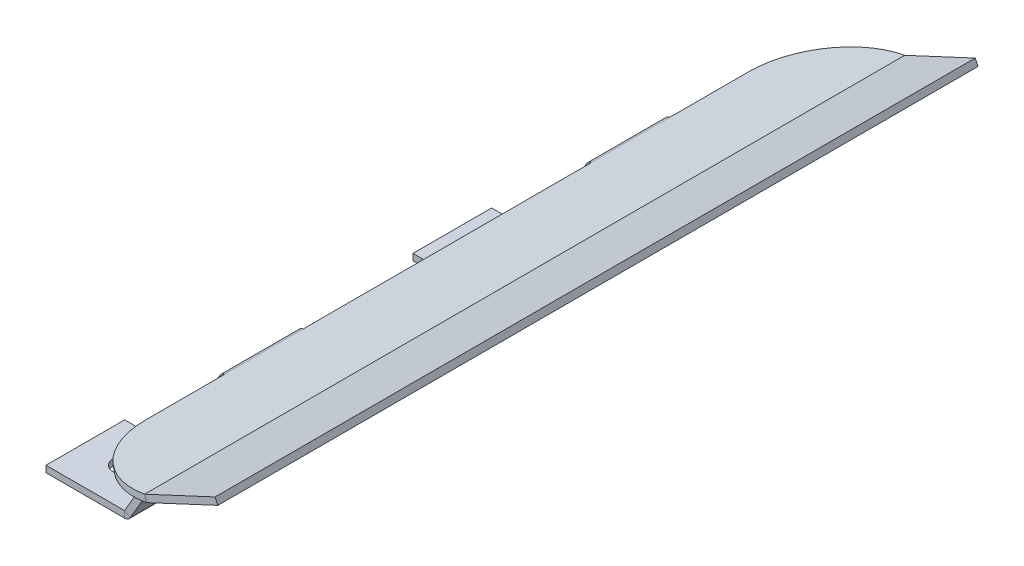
ISO-10303-21;
HEADER;
FILE_DESCRIPTION(('STEP AP214'),'2;1');
FILE_NAME('part.step','',(''),(''),'','','');
FILE_SCHEMA(('AUTOMOTIVE_DESIGN { 1 0 10303 214 1 1 1 1 }'));
ENDSEC;
DATA;
#1=APPLICATION_CONTEXT('core data for automotive mechanical design processes');
#2=APPLICATION_PROTOCOL_DEFINITION('international standard','automotive_design',2000,#1);
#3=PRODUCT_CONTEXT('',#1,'mechanical');
#4=PRODUCT('Part','Part','',(#3));
#5=PRODUCT_RELATED_PRODUCT_CATEGORY('part','',(#4));
#6=PRODUCT_DEFINITION_FORMATION('','',#4);
#7=PRODUCT_DEFINITION_CONTEXT('part definition',#1,'design');
#8=PRODUCT_DEFINITION('design','',#6,#7);
#9=PRODUCT_DEFINITION_SHAPE('','',#8);
#10=(LENGTH_UNIT() NAMED_UNIT(*) SI_UNIT(.MILLI.,.METRE.));
#11=(NAMED_UNIT(*) PLANE_ANGLE_UNIT() SI_UNIT($,.RADIAN.));
#12=(NAMED_UNIT(*) SI_UNIT($,.STERADIAN.) SOLID_ANGLE_UNIT());
#13=UNCERTAINTY_MEASURE_WITH_UNIT(LENGTH_MEASURE(1.E-05),#10,'distance_accuracy_value','');
#14=(GEOMETRIC_REPRESENTATION_CONTEXT(3) GLOBAL_UNCERTAINTY_ASSIGNED_CONTEXT((#13)) GLOBAL_UNIT_ASSIGNED_CONTEXT((#10,
#11,#12)) REPRESENTATION_CONTEXT('',''));
#15=CARTESIAN_POINT('',(0.,0.,0.));
#16=DIRECTION('',(0.,0.,1.));
#17=DIRECTION('',(1.,0.,0.));
#18=AXIS2_PLACEMENT_3D('',#15,#16,#17);
#19=CARTESIAN_POINT('',(-9.26145696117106,35.9192102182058,-46.));
#20=DIRECTION('',(-0.86602540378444,0.499999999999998,0.));
#21=DIRECTION('',(0.,0.,1.));
#22=AXIS2_PLACEMENT_3D('',#19,#20,#21);
#23=PLANE('',#22);
#24=DIRECTION('',(0.499999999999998,0.86602540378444,0.));
#25=VECTOR('',#24,1.);
#26=CARTESIAN_POINT('',(-36.261456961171,-10.846161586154,-22.));
#27=LINE('',#26,#25);
#28=CARTESIAN_POINT('',(-29.9991339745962,0.0005000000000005,-22.));
#29=VERTEX_POINT('',#28);
#30=CARTESIAN_POINT('',(-15.4948439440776,25.1226672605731,-22.));
#31=VERTEX_POINT('',#30);
#32=EDGE_CURVE('E63',#29,#31,#27,.T.);
#33=ORIENTED_EDGE('',*,*,#32,.T.);
#34=DIRECTION('',(0.,0.,-1.));
#35=VECTOR('',#34,1.);
#36=CARTESIAN_POINT('',(-15.4948439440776,25.1226672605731,-46.));
#37=LINE('',#36,#35);
#38=CARTESIAN_POINT('',(-15.4948439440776,25.1226672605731,-34.));
#39=VERTEX_POINT('',#38);
#40=EDGE_CURVE('E55',#31,#39,#37,.T.);
#41=ORIENTED_EDGE('',*,*,#40,.T.);
#42=DIRECTION('',(-0.499999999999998,-0.86602540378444,0.));
#43=VECTOR('',#42,1.);
#44=CARTESIAN_POINT('',(-15.261456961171,25.5269053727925,-34.));
#45=LINE('',#44,#43);
#46=CARTESIAN_POINT('',(-29.9991339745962,0.0005000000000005,-34.));
#47=VERTEX_POINT('',#46);
#48=EDGE_CURVE('E70',#39,#47,#45,.T.);
#49=ORIENTED_EDGE('',*,*,#48,.T.);
#50=DIRECTION('',(0.,0.,-1.));
#51=VECTOR('',#50,1.);
#52=CARTESIAN_POINT('',(-29.9991339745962,0.000499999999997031,-46.));
#53=LINE('',#52,#51);
#54=EDGE_CURVE('E554',#29,#47,#53,.T.);
#55=ORIENTED_EDGE('',*,*,#54,.F.);
#56=EDGE_LOOP('',(#33,#41,#49,#55));
#57=FACE_BOUND('',#56,.T.);
#58=ADVANCED_FACE('F46',(#57),#23,.T.);
#59=CARTESIAN_POINT('',(-35.3954315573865,-11.346161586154,-22.));
#60=DIRECTION('',(0.,0.,1.));
#61=DIRECTION('',(0.499999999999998,0.86602540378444,0.));
#62=AXIS2_PLACEMENT_3D('',#59,#60,#61);
#63=PLANE('',#62);
#64=DIRECTION('',(0.499999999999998,0.86602540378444,0.));
#65=VECTOR('',#64,1.);
#66=CARTESIAN_POINT('',(-35.3954315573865,-11.346161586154,-22.));
#67=LINE('',#66,#65);
#68=CARTESIAN_POINT('',(-29.1331085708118,-0.499499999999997,-22.));
#69=VERTEX_POINT('',#68);
#70=CARTESIAN_POINT('',(-14.6288185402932,24.6226672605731,-22.));
#71=VERTEX_POINT('',#70);
#72=EDGE_CURVE('E566',#69,#71,#67,.T.);
#73=ORIENTED_EDGE('',*,*,#72,.T.);
#74=DIRECTION('',(-0.86602540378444,0.499999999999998,0.));
#75=VECTOR('',#74,1.);
#76=CARTESIAN_POINT('',(-14.6288185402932,24.6226672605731,-22.));
#77=LINE('',#76,#75);
#78=EDGE_CURVE('E12',#71,#31,#77,.T.);
#79=ORIENTED_EDGE('',*,*,#78,.T.);
#80=ORIENTED_EDGE('',*,*,#32,.F.);
#81=DIRECTION('',(-0.86602540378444,0.499999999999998,0.));
#82=VECTOR('',#81,1.);
#83=CARTESIAN_POINT('',(-29.1331085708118,-0.499499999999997,-22.));
#84=LINE('',#83,#82);
#85=EDGE_CURVE('E551',#69,#29,#84,.T.);
#86=ORIENTED_EDGE('',*,*,#85,.F.);
#87=EDGE_LOOP('',(#73,#79,#80,#86));
#88=FACE_BOUND('',#87,.T.);
#89=ADVANCED_FACE('F48',(#88),#63,.T.);
#90=CARTESIAN_POINT('',(-14.3954315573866,25.0269053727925,-34.));
#91=DIRECTION('',(0.,0.,-1.));
#92=DIRECTION('',(-0.499999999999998,-0.86602540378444,0.));
#93=AXIS2_PLACEMENT_3D('',#90,#91,#92);
#94=PLANE('',#93);
#95=ORIENTED_EDGE('',*,*,#48,.F.);
#96=DIRECTION('',(0.86602540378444,-0.499999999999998,0.));
#97=VECTOR('',#96,1.);
#98=CARTESIAN_POINT('',(-14.6288185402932,24.6226672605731,-34.));
#99=LINE('',#98,#97);
#100=CARTESIAN_POINT('',(-14.6288185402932,24.6226672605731,-34.));
#101=VERTEX_POINT('',#100);
#102=EDGE_CURVE('E563',#39,#101,#99,.T.);
#103=ORIENTED_EDGE('',*,*,#102,.T.);
#104=DIRECTION('',(-0.499999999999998,-0.86602540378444,0.));
#105=VECTOR('',#104,1.);
#106=CARTESIAN_POINT('',(-14.3954315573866,25.0269053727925,-34.));
#107=LINE('',#106,#105);
#108=CARTESIAN_POINT('',(-29.1331085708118,-0.499499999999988,-34.));
#109=VERTEX_POINT('',#108);
#110=EDGE_CURVE('E50',#101,#109,#107,.T.);
#111=ORIENTED_EDGE('',*,*,#110,.T.);
#112=DIRECTION('',(0.86602540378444,-0.499999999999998,0.));
#113=VECTOR('',#112,1.);
#114=CARTESIAN_POINT('',(-29.1331085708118,-0.4995,-34.));
#115=LINE('',#114,#113);
#116=EDGE_CURVE('E557',#47,#109,#115,.T.);
#117=ORIENTED_EDGE('',*,*,#116,.F.);
#118=EDGE_LOOP('',(#95,#103,#111,#117));
#119=FACE_BOUND('',#118,.T.);
#120=ADVANCED_FACE('F571',(#119),#94,.T.);
#121=CARTESIAN_POINT('',(-8.39543155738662,35.4192102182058,-46.));
#122=DIRECTION('',(-0.86602540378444,0.499999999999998,0.));
#123=DIRECTION('',(0.,0.,1.));
#124=AXIS2_PLACEMENT_3D('',#121,#122,#123);
#125=PLANE('',#124);
#126=DIRECTION('',(0.,0.,-1.));
#127=VECTOR('',#126,1.);
#128=CARTESIAN_POINT('',(-14.6288185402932,24.6226672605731,-46.));
#129=LINE('',#128,#127);
#130=EDGE_CURVE('E560',#71,#101,#129,.T.);
#131=ORIENTED_EDGE('',*,*,#130,.F.);
#132=ORIENTED_EDGE('',*,*,#72,.F.);
#133=DIRECTION('',(0.,0.,-1.));
#134=VECTOR('',#133,1.);
#135=CARTESIAN_POINT('',(-29.1331085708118,-0.4995,-46.));
#136=LINE('',#135,#134);
#137=EDGE_CURVE('E548',#69,#109,#136,.T.);
#138=ORIENTED_EDGE('',*,*,#137,.T.);
#139=ORIENTED_EDGE('',*,*,#110,.F.);
#140=EDGE_LOOP('',(#131,#132,#138,#139));
#141=FACE_BOUND('',#140,.T.);
#142=ADVANCED_FACE('F625',(#141),#125,.F.);
#143=CARTESIAN_POINT('',(-30.,0.000999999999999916,-22.));
#144=DIRECTION('',(0.,0.,1.));
#145=DIRECTION('',(1.,0.,0.));
#146=AXIS2_PLACEMENT_3D('',#143,#144,#145);
#147=PLANE('',#146);
#148=ORIENTED_EDGE('',*,*,#85,.T.);
#149=CARTESIAN_POINT('',(-30.,0.000999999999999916,-22.));
#150=DIRECTION('',(0.,0.,1.));
#151=DIRECTION('',(1.,0.,0.));
#152=AXIS2_PLACEMENT_3D('',#149,#150,#151);
#153=CIRCLE('',#152,0.000999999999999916);
#154=CARTESIAN_POINT('',(-30.,0.,-22.));
#155=VERTEX_POINT('',#154);
#156=EDGE_CURVE('E503',#29,#155,#153,.F.);
#157=ORIENTED_EDGE('',*,*,#156,.T.);
#158=DIRECTION('',(0.,1.,0.));
#159=VECTOR('',#158,1.);
#160=CARTESIAN_POINT('',(-30.,-1.,-22.));
#161=LINE('',#160,#159);
#162=CARTESIAN_POINT('',(-30.,-1.,-22.));
#163=VERTEX_POINT('',#162);
#164=EDGE_CURVE('E518',#163,#155,#161,.T.);
#165=ORIENTED_EDGE('',*,*,#164,.F.);
#166=CARTESIAN_POINT('',(-30.,0.000999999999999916,-22.));
#167=DIRECTION('',(0.,0.,-1.));
#168=DIRECTION('',(1.,0.,0.));
#169=AXIS2_PLACEMENT_3D('',#166,#167,#168);
#170=CIRCLE('',#169,1.001);
#171=EDGE_CURVE('E537',#69,#163,#170,.T.);
#172=ORIENTED_EDGE('',*,*,#171,.F.);
#173=EDGE_LOOP('',(#148,#157,#165,#172));
#174=FACE_BOUND('',#173,.T.);
#175=ADVANCED_FACE('F597',(#174),#147,.T.);
#176=CARTESIAN_POINT('',(-30.,0.000999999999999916,-34.));
#177=DIRECTION('',(0.,0.,-1.));
#178=DIRECTION('',(-1.,0.,0.));
#179=AXIS2_PLACEMENT_3D('',#176,#177,#178);
#180=PLANE('',#179);
#181=CARTESIAN_POINT('',(-30.,0.000999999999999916,-34.));
#182=DIRECTION('',(0.,0.,1.));
#183=DIRECTION('',(1.,0.,0.));
#184=AXIS2_PLACEMENT_3D('',#181,#182,#183);
#185=CIRCLE('',#184,0.000999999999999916);
#186=CARTESIAN_POINT('',(-30.,0.,-34.));
#187=VERTEX_POINT('',#186);
#188=EDGE_CURVE('E541',#187,#47,#185,.T.);
#189=ORIENTED_EDGE('',*,*,#188,.T.);
#190=ORIENTED_EDGE('',*,*,#116,.T.);
#191=CARTESIAN_POINT('',(-30.,0.000999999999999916,-34.));
#192=DIRECTION('',(0.,0.,1.));
#193=DIRECTION('',(-1.,0.,0.));
#194=AXIS2_PLACEMENT_3D('',#191,#192,#193);
#195=CIRCLE('',#194,1.001);
#196=CARTESIAN_POINT('',(-30.,-1.,-34.));
#197=VERTEX_POINT('',#196);
#198=EDGE_CURVE('E540',#197,#109,#195,.T.);
#199=ORIENTED_EDGE('',*,*,#198,.F.);
#200=DIRECTION('',(0.,-1.,0.));
#201=VECTOR('',#200,1.);
#202=CARTESIAN_POINT('',(-30.,-1.,-34.));
#203=LINE('',#202,#201);
#204=EDGE_CURVE('E506',#187,#197,#203,.T.);
#205=ORIENTED_EDGE('',*,*,#204,.F.);
#206=EDGE_LOOP('',(#189,#190,#199,#205));
#207=FACE_BOUND('',#206,.T.);
#208=ADVANCED_FACE('F581',(#207),#180,.T.);
#209=CARTESIAN_POINT('',(-30.,0.000999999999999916,-40.0530184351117));
#210=DIRECTION('',(0.,0.,1.));
#211=DIRECTION('',(1.,0.,0.));
#212=AXIS2_PLACEMENT_3D('',#209,#210,#211);
#213=CYLINDRICAL_SURFACE('',#212,1.001);
#214=DIRECTION('',(0.,0.,-1.));
#215=VECTOR('',#214,1.);
#216=CARTESIAN_POINT('',(-30.,-1.,-46.));
#217=LINE('',#216,#215);
#218=EDGE_CURVE('E368',#163,#197,#217,.T.);
#219=ORIENTED_EDGE('',*,*,#218,.T.);
#220=ORIENTED_EDGE('',*,*,#198,.T.);
#221=ORIENTED_EDGE('',*,*,#137,.F.);
#222=ORIENTED_EDGE('',*,*,#171,.T.);
#223=EDGE_LOOP('',(#219,#220,#221,#222));
#224=FACE_BOUND('',#223,.T.);
#225=ADVANCED_FACE('F592',(#224),#213,.T.);
#226=CARTESIAN_POINT('',(-30.,0.000999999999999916,-40.0530184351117));
#227=DIRECTION('',(0.,0.,1.));
#228=DIRECTION('',(1.,0.,0.));
#229=AXIS2_PLACEMENT_3D('',#226,#227,#228);
#230=CYLINDRICAL_SURFACE('',#229,0.000999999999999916);
#231=DIRECTION('',(0.,0.,-1.));
#232=VECTOR('',#231,1.);
#233=CARTESIAN_POINT('',(-30.,0.,-46.));
#234=LINE('',#233,#232);
#235=EDGE_CURVE('E513',#155,#187,#234,.T.);
#236=ORIENTED_EDGE('',*,*,#235,.F.);
#237=ORIENTED_EDGE('',*,*,#156,.F.);
#238=ORIENTED_EDGE('',*,*,#54,.T.);
#239=ORIENTED_EDGE('',*,*,#188,.F.);
#240=EDGE_LOOP('',(#236,#237,#238,#239));
#241=FACE_BOUND('',#240,.T.);
#242=ADVANCED_FACE('F579',(#241),#230,.F.);
#243=CARTESIAN_POINT('',(-36.,-1.,-28.));
#244=DIRECTION('',(0.,1.,0.));
#245=DIRECTION('',(0.,0.,1.));
#246=AXIS2_PLACEMENT_3D('',#243,#244,#245);
#247=CYLINDRICAL_SURFACE('',#246,1.75);
#248=CARTESIAN_POINT('',(-36.,-1.,-28.));
#249=DIRECTION('',(0.,1.,0.));
#250=DIRECTION('',(0.,0.,1.));
#251=AXIS2_PLACEMENT_3D('',#248,#249,#250);
#252=CIRCLE('',#251,1.75);
#253=CARTESIAN_POINT('',(-36.,-1.,-26.25));
#254=VERTEX_POINT('',#253);
#255=EDGE_CURVE('E524',#254,#254,#252,.T.);
#256=ORIENTED_EDGE('',*,*,#255,.F.);
#257=EDGE_LOOP('',(#256));
#258=FACE_BOUND('',#257,.T.);
#259=CARTESIAN_POINT('',(-36.,0.,-28.));
#260=DIRECTION('',(0.,1.,0.));
#261=DIRECTION('',(0.,0.,1.));
#262=AXIS2_PLACEMENT_3D('',#259,#260,#261);
#263=CIRCLE('',#262,1.75);
#264=CARTESIAN_POINT('',(-36.,0.,-26.25));
#265=VERTEX_POINT('',#264);
#266=EDGE_CURVE('E532',#265,#265,#263,.T.);
#267=ORIENTED_EDGE('',*,*,#266,.T.);
#268=EDGE_LOOP('',(#267));
#269=FACE_BOUND('',#268,.T.);
#270=ADVANCED_FACE('F608',(#258,#269),#247,.F.);
#271=CARTESIAN_POINT('',(-42.,-1.,-34.));
#272=DIRECTION('',(-1.,0.,0.));
#273=DIRECTION('',(0.,0.,1.));
#274=AXIS2_PLACEMENT_3D('',#271,#272,#273);
#275=PLANE('',#274);
#276=DIRECTION('',(0.,0.,1.));
#277=VECTOR('',#276,1.);
#278=CARTESIAN_POINT('',(-42.,0.,-34.));
#279=LINE('',#278,#277);
#280=CARTESIAN_POINT('',(-42.,0.,-34.));
#281=VERTEX_POINT('',#280);
#282=CARTESIAN_POINT('',(-42.,0.,-22.));
#283=VERTEX_POINT('',#282);
#284=EDGE_CURVE('E508',#281,#283,#279,.T.);
#285=ORIENTED_EDGE('',*,*,#284,.F.);
#286=DIRECTION('',(0.,1.,0.));
#287=VECTOR('',#286,1.);
#288=CARTESIAN_POINT('',(-42.,-1.,-34.));
#289=LINE('',#288,#287);
#290=CARTESIAN_POINT('',(-42.,-1.,-34.));
#291=VERTEX_POINT('',#290);
#292=EDGE_CURVE('E500',#291,#281,#289,.T.);
#293=ORIENTED_EDGE('',*,*,#292,.F.);
#294=DIRECTION('',(0.,0.,1.));
#295=VECTOR('',#294,1.);
#296=CARTESIAN_POINT('',(-42.,-1.,-34.));
#297=LINE('',#296,#295);
#298=CARTESIAN_POINT('',(-42.,-1.,-22.));
#299=VERTEX_POINT('',#298);
#300=EDGE_CURVE('E529',#291,#299,#297,.T.);
#301=ORIENTED_EDGE('',*,*,#300,.T.);
#302=DIRECTION('',(0.,1.,0.));
#303=VECTOR('',#302,1.);
#304=CARTESIAN_POINT('',(-42.,-1.,-22.));
#305=LINE('',#304,#303);
#306=EDGE_CURVE('E527',#299,#283,#305,.T.);
#307=ORIENTED_EDGE('',*,*,#306,.T.);
#308=EDGE_LOOP('',(#285,#293,#301,#307));
#309=FACE_BOUND('',#308,.T.);
#310=ADVANCED_FACE('F606',(#309),#275,.T.);
#311=CARTESIAN_POINT('',(12.,-1.,-46.));
#312=DIRECTION('',(0.,1.,0.));
#313=DIRECTION('',(0.,0.,1.));
#314=AXIS2_PLACEMENT_3D('',#311,#312,#313);
#315=PLANE('',#314);
#316=ORIENTED_EDGE('',*,*,#218,.F.);
#317=DIRECTION('',(1.,0.,0.));
#318=VECTOR('',#317,1.);
#319=CARTESIAN_POINT('',(-42.,-1.,-22.));
#320=LINE('',#319,#318);
#321=EDGE_CURVE('E521',#299,#163,#320,.T.);
#322=ORIENTED_EDGE('',*,*,#321,.F.);
#323=ORIENTED_EDGE('',*,*,#300,.F.);
#324=DIRECTION('',(-1.,0.,0.));
#325=VECTOR('',#324,1.);
#326=CARTESIAN_POINT('',(0.,-1.,-34.));
#327=LINE('',#326,#325);
#328=EDGE_CURVE('E504',#197,#291,#327,.T.);
#329=ORIENTED_EDGE('',*,*,#328,.F.);
#330=EDGE_LOOP('',(#316,#322,#323,#329));
#331=FACE_BOUND('',#330,.T.);
#332=ORIENTED_EDGE('',*,*,#255,.T.);
#333=EDGE_LOOP('',(#332));
#334=FACE_BOUND('',#333,.T.);
#335=ADVANCED_FACE('F588',(#331,#334),#315,.F.);
#336=CARTESIAN_POINT('',(-42.,-1.,-22.));
#337=DIRECTION('',(0.,0.,1.));
#338=DIRECTION('',(1.,0.,0.));
#339=AXIS2_PLACEMENT_3D('',#336,#337,#338);
#340=PLANE('',#339);
#341=ORIENTED_EDGE('',*,*,#321,.T.);
#342=ORIENTED_EDGE('',*,*,#164,.T.);
#343=DIRECTION('',(1.,0.,0.));
#344=VECTOR('',#343,1.);
#345=CARTESIAN_POINT('',(-42.,0.,-22.));
#346=LINE('',#345,#344);
#347=EDGE_CURVE('E516',#283,#155,#346,.T.);
#348=ORIENTED_EDGE('',*,*,#347,.F.);
#349=ORIENTED_EDGE('',*,*,#306,.F.);
#350=EDGE_LOOP('',(#341,#342,#348,#349));
#351=FACE_BOUND('',#350,.T.);
#352=ADVANCED_FACE('F601',(#351),#340,.T.);
#353=CARTESIAN_POINT('',(12.,0.,-46.));
#354=DIRECTION('',(0.,1.,0.));
#355=DIRECTION('',(0.,0.,1.));
#356=AXIS2_PLACEMENT_3D('',#353,#354,#355);
#357=PLANE('',#356);
#358=ORIENTED_EDGE('',*,*,#266,.F.);
#359=EDGE_LOOP('',(#358));
#360=FACE_BOUND('',#359,.T.);
#361=ORIENTED_EDGE('',*,*,#347,.T.);
#362=ORIENTED_EDGE('',*,*,#235,.T.);
#363=DIRECTION('',(-1.,0.,0.));
#364=VECTOR('',#363,1.);
#365=CARTESIAN_POINT('',(0.,0.,-34.));
#366=LINE('',#365,#364);
#367=EDGE_CURVE('E511',#187,#281,#366,.T.);
#368=ORIENTED_EDGE('',*,*,#367,.T.);
#369=ORIENTED_EDGE('',*,*,#284,.T.);
#370=EDGE_LOOP('',(#361,#362,#368,#369));
#371=FACE_BOUND('',#370,.T.);
#372=ADVANCED_FACE('F603',(#360,#371),#357,.T.);
#373=CARTESIAN_POINT('',(0.,-1.,-34.));
#374=DIRECTION('',(0.,0.,-1.));
#375=DIRECTION('',(-1.,0.,0.));
#376=AXIS2_PLACEMENT_3D('',#373,#374,#375);
#377=PLANE('',#376);
#378=ORIENTED_EDGE('',*,*,#367,.F.);
#379=ORIENTED_EDGE('',*,*,#204,.T.);
#380=ORIENTED_EDGE('',*,*,#328,.T.);
#381=ORIENTED_EDGE('',*,*,#292,.T.);
#382=EDGE_LOOP('',(#378,#379,#380,#381));
#383=FACE_BOUND('',#382,.T.);
#384=ADVANCED_FACE('F584',(#383),#377,.T.);
#385=CARTESIAN_POINT('',(8.2247264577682,31.8066311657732,-58.));
#386=DIRECTION('',(0.906307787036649,0.4226182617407,0.));
#387=DIRECTION('',(0.,0.,-1.));
#388=AXIS2_PLACEMENT_3D('',#385,#386,#387);
#389=PLANE('',#388);
#390=DIRECTION('',(0.,0.,-1.));
#391=VECTOR('',#390,1.);
#392=CARTESIAN_POINT('',(7.8021081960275,32.7129389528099,-58.));
#393=LINE('',#392,#391);
#394=CARTESIAN_POINT('',(7.80210819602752,32.7129389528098,58.));
#395=VERTEX_POINT('',#394);
#396=CARTESIAN_POINT('',(7.8021081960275,32.7129389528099,-58.));
#397=VERTEX_POINT('',#396);
#398=EDGE_CURVE('E465',#395,#397,#393,.T.);
#399=ORIENTED_EDGE('',*,*,#398,.F.);
#400=DIRECTION('',(-0.4226182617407,0.906307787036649,0.));
#401=VECTOR('',#400,1.);
#402=CARTESIAN_POINT('',(8.22472645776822,31.8066311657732,58.));
#403=LINE('',#402,#401);
#404=CARTESIAN_POINT('',(8.22472645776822,31.8066311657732,58.));
#405=VERTEX_POINT('',#404);
#406=EDGE_CURVE('E473',#405,#395,#403,.T.);
#407=ORIENTED_EDGE('',*,*,#406,.F.);
#408=DIRECTION('',(0.,0.,-1.));
#409=VECTOR('',#408,1.);
#410=CARTESIAN_POINT('',(8.2247264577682,31.8066311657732,-58.));
#411=LINE('',#410,#409);
#412=CARTESIAN_POINT('',(8.2247264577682,31.8066311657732,-58.));
#413=VERTEX_POINT('',#412);
#414=EDGE_CURVE('E480',#405,#413,#411,.T.);
#415=ORIENTED_EDGE('',*,*,#414,.T.);
#416=DIRECTION('',(-0.4226182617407,0.906307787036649,0.));
#417=VECTOR('',#416,1.);
#418=CARTESIAN_POINT('',(8.2247264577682,31.8066311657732,-58.));
#419=LINE('',#418,#417);
#420=EDGE_CURVE('E478',#413,#397,#419,.T.);
#421=ORIENTED_EDGE('',*,*,#420,.T.);
#422=EDGE_LOOP('',(#399,#407,#415,#421));
#423=FACE_BOUND('',#422,.T.);
#424=ADVANCED_FACE('F639',(#423),#389,.T.);
#425=CARTESIAN_POINT('',(-2.65096698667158,26.7352120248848,58.));
#426=DIRECTION('',(0.,0.,1.));
#427=DIRECTION('',(0.906307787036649,0.4226182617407,0.));
#428=AXIS2_PLACEMENT_3D('',#425,#426,#427);
#429=PLANE('',#428);
#430=DIRECTION('',(-0.4226182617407,0.906307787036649,0.));
#431=VECTOR('',#430,1.);
#432=CARTESIAN_POINT('',(-2.53209430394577,26.7906432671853,58.));
#433=LINE('',#432,#431);
#434=CARTESIAN_POINT('',(-2.53209430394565,26.7906432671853,58.));
#435=VERTEX_POINT('',#434);
#436=CARTESIAN_POINT('',(-2.95471256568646,27.6969510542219,58.));
#437=VERTEX_POINT('',#436);
#438=EDGE_CURVE('E460',#435,#437,#433,.T.);
#439=ORIENTED_EDGE('',*,*,#438,.F.);
#440=DIRECTION('',(0.906307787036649,0.4226182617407,0.));
#441=VECTOR('',#440,1.);
#442=CARTESIAN_POINT('',(-2.65096698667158,26.7352120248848,58.));
#443=LINE('',#442,#441);
#444=EDGE_CURVE('E476',#435,#405,#443,.T.);
#445=ORIENTED_EDGE('',*,*,#444,.T.);
#446=ORIENTED_EDGE('',*,*,#406,.T.);
#447=DIRECTION('',(0.906307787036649,0.4226182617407,0.));
#448=VECTOR('',#447,1.);
#449=CARTESIAN_POINT('',(-3.07358524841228,27.6415198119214,58.));
#450=LINE('',#449,#448);
#451=EDGE_CURVE('E468',#437,#395,#450,.T.);
#452=ORIENTED_EDGE('',*,*,#451,.F.);
#453=EDGE_LOOP('',(#439,#445,#446,#452));
#454=FACE_BOUND('',#453,.T.);
#455=ADVANCED_FACE('F662',(#454),#429,.T.);
#456=CARTESIAN_POINT('',(-2.65096698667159,26.7352120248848,-58.));
#457=DIRECTION('',(0.,0.,-1.));
#458=DIRECTION('',(-0.906307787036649,-0.4226182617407,0.));
#459=AXIS2_PLACEMENT_3D('',#456,#457,#458);
#460=PLANE('',#459);
#461=DIRECTION('',(0.4226182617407,-0.906307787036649,0.));
#462=VECTOR('',#461,1.);
#463=CARTESIAN_POINT('',(-2.53209430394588,26.7906432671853,-58.));
#464=LINE('',#463,#462);
#465=CARTESIAN_POINT('',(-2.95471256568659,27.6969510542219,-58.));
#466=VERTEX_POINT('',#465);
#467=CARTESIAN_POINT('',(-2.53209430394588,26.7906432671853,-58.));
#468=VERTEX_POINT('',#467);
#469=EDGE_CURVE('E449',#466,#468,#464,.T.);
#470=ORIENTED_EDGE('',*,*,#469,.F.);
#471=DIRECTION('',(-0.906307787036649,-0.4226182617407,0.));
#472=VECTOR('',#471,1.);
#473=CARTESIAN_POINT('',(-3.07358524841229,27.6415198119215,-58.));
#474=LINE('',#473,#472);
#475=EDGE_CURVE('E462',#397,#466,#474,.T.);
#476=ORIENTED_EDGE('',*,*,#475,.F.);
#477=ORIENTED_EDGE('',*,*,#420,.F.);
#478=DIRECTION('',(-0.906307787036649,-0.4226182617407,0.));
#479=VECTOR('',#478,1.);
#480=CARTESIAN_POINT('',(-2.65096698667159,26.7352120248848,-58.));
#481=LINE('',#480,#479);
#482=EDGE_CURVE('E470',#413,#468,#481,.T.);
#483=ORIENTED_EDGE('',*,*,#482,.T.);
#484=EDGE_LOOP('',(#470,#476,#477,#483));
#485=FACE_BOUND('',#484,.T.);
#486=ADVANCED_FACE('F671',(#485),#460,.T.);
#487=CARTESIAN_POINT('',(-3.07358524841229,27.6415198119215,-46.));
#488=DIRECTION('',(-0.4226182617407,0.906307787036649,0.));
#489=DIRECTION('',(0.,0.,1.));
#490=AXIS2_PLACEMENT_3D('',#487,#488,#489);
#491=PLANE('',#490);
#492=DIRECTION('',(0.,0.,-1.));
#493=VECTOR('',#492,1.);
#494=CARTESIAN_POINT('',(-2.95471256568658,27.6969510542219,-46.));
#495=LINE('',#494,#493);
#496=EDGE_CURVE('E445',#437,#466,#495,.T.);
#497=ORIENTED_EDGE('',*,*,#496,.F.);
#498=ORIENTED_EDGE('',*,*,#451,.T.);
#499=ORIENTED_EDGE('',*,*,#398,.T.);
#500=ORIENTED_EDGE('',*,*,#475,.T.);
#501=EDGE_LOOP('',(#497,#498,#499,#500));
#502=FACE_BOUND('',#501,.T.);
#503=ADVANCED_FACE('F679',(#502),#491,.T.);
#504=CARTESIAN_POINT('',(-2.95513518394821,27.6978573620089,58.));
#505=DIRECTION('',(0.,0.,1.));
#506=DIRECTION('',(0.984807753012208,0.173648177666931,0.));
#507=AXIS2_PLACEMENT_3D('',#504,#505,#506);
#508=PLANE('',#507);
#509=ORIENTED_EDGE('',*,*,#438,.T.);
#510=CARTESIAN_POINT('',(-2.95513518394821,27.6978573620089,58.));
#511=DIRECTION('',(0.,0.,1.));
#512=DIRECTION('',(0.984807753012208,0.173648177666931,0.));
#513=AXIS2_PLACEMENT_3D('',#510,#511,#512);
#514=CIRCLE('',#513,0.000999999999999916);
#515=CARTESIAN_POINT('',(-2.95496153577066,27.6968725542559,58.));
#516=VERTEX_POINT('',#515);
#517=EDGE_CURVE('E458',#437,#516,#514,.F.);
#518=ORIENTED_EDGE('',*,*,#517,.T.);
#519=DIRECTION('',(-0.173648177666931,0.984807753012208,0.));
#520=VECTOR('',#519,1.);
#521=CARTESIAN_POINT('',(-2.78131335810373,26.7120648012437,58.));
#522=LINE('',#521,#520);
#523=CARTESIAN_POINT('',(-2.78131335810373,26.7120648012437,58.));
#524=VERTEX_POINT('',#523);
#525=EDGE_CURVE('E434',#524,#516,#522,.T.);
#526=ORIENTED_EDGE('',*,*,#525,.F.);
#527=CARTESIAN_POINT('',(-2.95513518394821,27.6978573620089,58.));
#528=DIRECTION('',(0.,0.,-1.));
#529=DIRECTION('',(0.984807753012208,0.173648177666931,0.));
#530=AXIS2_PLACEMENT_3D('',#527,#528,#529);
#531=CIRCLE('',#530,1.001);
#532=EDGE_CURVE('E427',#435,#524,#531,.T.);
#533=ORIENTED_EDGE('',*,*,#532,.F.);
#534=EDGE_LOOP('',(#509,#518,#526,#533));
#535=FACE_BOUND('',#534,.T.);
#536=ADVANCED_FACE('F687',(#535),#508,.T.);
#537=CARTESIAN_POINT('',(-2.65096698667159,26.7352120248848,-46.));
#538=DIRECTION('',(-0.4226182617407,0.906307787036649,0.));
#539=DIRECTION('',(0.,0.,1.));
#540=AXIS2_PLACEMENT_3D('',#537,#538,#539);
#541=PLANE('',#540);
#542=ORIENTED_EDGE('',*,*,#444,.F.);
#543=DIRECTION('',(0.,0.,-1.));
#544=VECTOR('',#543,1.);
#545=CARTESIAN_POINT('',(-2.53209430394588,26.7906432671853,-46.));
#546=LINE('',#545,#544);
#547=EDGE_CURVE('E455',#435,#468,#546,.T.);
#548=ORIENTED_EDGE('',*,*,#547,.T.);
#549=ORIENTED_EDGE('',*,*,#482,.F.);
#550=ORIENTED_EDGE('',*,*,#414,.F.);
#551=EDGE_LOOP('',(#542,#548,#549,#550));
#552=FACE_BOUND('',#551,.T.);
#553=ADVANCED_FACE('F695',(#552),#541,.F.);
#554=CARTESIAN_POINT('',(-2.95513518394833,27.6978573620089,-58.));
#555=DIRECTION('',(0.,0.,-1.));
#556=DIRECTION('',(-0.984807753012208,-0.173648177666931,0.));
#557=AXIS2_PLACEMENT_3D('',#554,#555,#556);
#558=PLANE('',#557);
#559=CARTESIAN_POINT('',(-2.95513518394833,27.6978573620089,-58.));
#560=DIRECTION('',(0.,0.,1.));
#561=DIRECTION('',(0.984807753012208,0.173648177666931,0.));
#562=AXIS2_PLACEMENT_3D('',#559,#560,#561);
#563=CIRCLE('',#562,0.000999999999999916);
#564=CARTESIAN_POINT('',(-2.95496153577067,27.6968725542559,-58.));
#565=VERTEX_POINT('',#564);
#566=EDGE_CURVE('E452',#565,#466,#563,.T.);
#567=ORIENTED_EDGE('',*,*,#566,.T.);
#568=ORIENTED_EDGE('',*,*,#469,.T.);
#569=CARTESIAN_POINT('',(-2.95513518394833,27.6978573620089,-58.));
#570=DIRECTION('',(0.,0.,1.));
#571=DIRECTION('',(-0.984807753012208,-0.173648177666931,0.));
#572=AXIS2_PLACEMENT_3D('',#569,#570,#571);
#573=CIRCLE('',#572,1.001);
#574=CARTESIAN_POINT('',(-2.78131335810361,26.7120648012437,-58.));
#575=VERTEX_POINT('',#574);
#576=EDGE_CURVE('E430',#575,#468,#573,.T.);
#577=ORIENTED_EDGE('',*,*,#576,.F.);
#578=DIRECTION('',(-0.173648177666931,0.984807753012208,0.));
#579=VECTOR('',#578,1.);
#580=CARTESIAN_POINT('',(-2.78131335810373,26.7120648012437,-58.));
#581=LINE('',#580,#579);
#582=EDGE_CURVE('E447',#575,#565,#581,.T.);
#583=ORIENTED_EDGE('',*,*,#582,.T.);
#584=EDGE_LOOP('',(#567,#568,#577,#583));
#585=FACE_BOUND('',#584,.T.);
#586=ADVANCED_FACE('F703',(#585),#558,.T.);
#587=CARTESIAN_POINT('',(-2.9551351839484,27.6978573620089,-116.004384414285));
#588=DIRECTION('',(0.,0.,1.));
#589=DIRECTION('',(0.984807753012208,0.173648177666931,0.));
#590=AXIS2_PLACEMENT_3D('',#587,#588,#589);
#591=CYLINDRICAL_SURFACE('',#590,0.000999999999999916);
#592=DIRECTION('',(0.,0.,-1.));
#593=VECTOR('',#592,1.);
#594=CARTESIAN_POINT('',(-2.95496153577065,27.6968725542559,-46.));
#595=LINE('',#594,#593);
#596=EDGE_CURVE('E393',#516,#565,#595,.T.);
#597=ORIENTED_EDGE('',*,*,#596,.F.);
#598=ORIENTED_EDGE('',*,*,#517,.F.);
#599=ORIENTED_EDGE('',*,*,#496,.T.);
#600=ORIENTED_EDGE('',*,*,#566,.F.);
#601=EDGE_LOOP('',(#597,#598,#599,#600));
#602=FACE_BOUND('',#601,.T.);
#603=ADVANCED_FACE('F711',(#602),#591,.F.);
#604=CARTESIAN_POINT('',(-14.5990063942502,24.6282866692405,46.));
#605=DIRECTION('',(-0.984807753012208,-0.173648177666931,0.));
#606=DIRECTION('',(0.,0.,1.));
#607=AXIS2_PLACEMENT_3D('',#604,#605,#606);
#608=PLANE('',#607);
#609=DIRECTION('',(0.,0.,1.));
#610=VECTOR('',#609,1.);
#611=CARTESIAN_POINT('',(-14.7726545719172,25.6130944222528,46.));
#612=LINE('',#611,#610);
#613=CARTESIAN_POINT('',(-14.7726545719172,25.6130944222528,34.));
#614=VERTEX_POINT('',#613);
#615=CARTESIAN_POINT('',(-14.7726545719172,25.6130944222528,46.));
#616=VERTEX_POINT('',#615);
#617=EDGE_CURVE('E399',#614,#616,#612,.T.);
#618=ORIENTED_EDGE('',*,*,#617,.F.);
#619=DIRECTION('',(-0.173648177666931,0.984807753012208,0.));
#620=VECTOR('',#619,1.);
#621=CARTESIAN_POINT('',(-14.5990063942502,24.6282866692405,34.));
#622=LINE('',#621,#620);
#623=CARTESIAN_POINT('',(-14.5990063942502,24.6282866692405,34.));
#624=VERTEX_POINT('',#623);
#625=EDGE_CURVE('E365',#624,#614,#622,.T.);
#626=ORIENTED_EDGE('',*,*,#625,.F.);
#627=DIRECTION('',(0.,0.,1.));
#628=VECTOR('',#627,1.);
#629=CARTESIAN_POINT('',(-14.5990063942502,24.6282866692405,46.));
#630=LINE('',#629,#628);
#631=CARTESIAN_POINT('',(-14.5990063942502,24.6282866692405,46.));
#632=VERTEX_POINT('',#631);
#633=EDGE_CURVE('E442',#624,#632,#630,.T.);
#634=ORIENTED_EDGE('',*,*,#633,.T.);
#635=DIRECTION('',(-0.173648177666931,0.984807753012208,0.));
#636=VECTOR('',#635,1.);
#637=CARTESIAN_POINT('',(-14.5990063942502,24.6282866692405,46.));
#638=LINE('',#637,#636);
#639=EDGE_CURVE('E440',#632,#616,#638,.T.);
#640=ORIENTED_EDGE('',*,*,#639,.T.);
#641=EDGE_LOOP('',(#618,#626,#634,#640));
#642=FACE_BOUND('',#641,.T.);
#643=ADVANCED_FACE('F719',(#642),#608,.T.);
#644=CARTESIAN_POINT('',(-2.78131335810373,26.7120648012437,46.));
#645=DIRECTION('',(-0.173648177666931,0.984807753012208,0.));
#646=DIRECTION('',(0.,0.,1.));
#647=AXIS2_PLACEMENT_3D('',#644,#645,#646);
#648=CYLINDRICAL_SURFACE('',#647,12.);
#649=CARTESIAN_POINT('',(-2.95496153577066,27.6968725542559,46.));
#650=DIRECTION('',(-0.173648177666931,0.984807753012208,0.));
#651=DIRECTION('',(0.,0.,-1.));
#652=AXIS2_PLACEMENT_3D('',#649,#650,#651);
#653=CIRCLE('',#652,12.);
#654=EDGE_CURVE('E396',#616,#516,#653,.T.);
#655=ORIENTED_EDGE('',*,*,#654,.F.);
#656=ORIENTED_EDGE('',*,*,#639,.F.);
#657=CARTESIAN_POINT('',(-2.78131335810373,26.7120648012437,46.));
#658=DIRECTION('',(-0.173648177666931,0.984807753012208,0.));
#659=DIRECTION('',(0.,0.,-1.));
#660=AXIS2_PLACEMENT_3D('',#657,#658,#659);
#661=CIRCLE('',#660,12.);
#662=EDGE_CURVE('E437',#632,#524,#661,.T.);
#663=ORIENTED_EDGE('',*,*,#662,.T.);
#664=ORIENTED_EDGE('',*,*,#525,.T.);
#665=EDGE_LOOP('',(#655,#656,#663,#664));
#666=FACE_BOUND('',#665,.T.);
#667=ADVANCED_FACE('F727',(#666),#648,.T.);
#668=CARTESIAN_POINT('',(-2.9551351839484,27.6978573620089,-116.004384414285));
#669=DIRECTION('',(0.,0.,1.));
#670=DIRECTION('',(0.984807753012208,0.173648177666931,0.));
#671=AXIS2_PLACEMENT_3D('',#668,#669,#670);
#672=CYLINDRICAL_SURFACE('',#671,1.001);
#673=DIRECTION('',(0.,0.,-1.));
#674=VECTOR('',#673,1.);
#675=CARTESIAN_POINT('',(-2.78131335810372,26.7120648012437,-46.));
#676=LINE('',#675,#674);
#677=EDGE_CURVE('E432',#524,#575,#676,.T.);
#678=ORIENTED_EDGE('',*,*,#677,.T.);
#679=ORIENTED_EDGE('',*,*,#576,.T.);
#680=ORIENTED_EDGE('',*,*,#547,.F.);
#681=ORIENTED_EDGE('',*,*,#532,.T.);
#682=EDGE_LOOP('',(#678,#679,#680,#681));
#683=FACE_BOUND('',#682,.T.);
#684=ADVANCED_FACE('F735',(#683),#672,.T.);
#685=CARTESIAN_POINT('',(-2.78131335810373,26.7120648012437,-46.));
#686=DIRECTION('',(-0.173648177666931,0.984807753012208,0.));
#687=DIRECTION('',(0.,0.,1.));
#688=AXIS2_PLACEMENT_3D('',#685,#686,#687);
#689=CYLINDRICAL_SURFACE('',#688,12.);
#690=CARTESIAN_POINT('',(-2.95496153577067,27.6968725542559,-46.));
#691=DIRECTION('',(-0.173648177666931,0.984807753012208,0.));
#692=DIRECTION('',(0.,0.,1.));
#693=AXIS2_PLACEMENT_3D('',#690,#691,#692);
#694=CIRCLE('',#693,12.);
#695=CARTESIAN_POINT('',(-14.7726545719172,25.6130944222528,-46.));
#696=VERTEX_POINT('',#695);
#697=EDGE_CURVE('E390',#565,#696,#694,.T.);
#698=ORIENTED_EDGE('',*,*,#697,.F.);
#699=ORIENTED_EDGE('',*,*,#582,.F.);
#700=CARTESIAN_POINT('',(-2.78131335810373,26.7120648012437,-46.));
#701=DIRECTION('',(-0.173648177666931,0.984807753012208,0.));
#702=DIRECTION('',(0.,0.,1.));
#703=AXIS2_PLACEMENT_3D('',#700,#701,#702);
#704=CIRCLE('',#703,12.);
#705=CARTESIAN_POINT('',(-14.5990063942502,24.6282866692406,-46.));
#706=VERTEX_POINT('',#705);
#707=EDGE_CURVE('E424',#575,#706,#704,.T.);
#708=ORIENTED_EDGE('',*,*,#707,.T.);
#709=DIRECTION('',(-0.173648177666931,0.984807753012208,0.));
#710=VECTOR('',#709,1.);
#711=CARTESIAN_POINT('',(-14.5990063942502,24.6282866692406,-46.));
#712=LINE('',#711,#710);
#713=EDGE_CURVE('E422',#706,#696,#712,.T.);
#714=ORIENTED_EDGE('',*,*,#713,.T.);
#715=EDGE_LOOP('',(#698,#699,#708,#714));
#716=FACE_BOUND('',#715,.T.);
#717=ADVANCED_FACE('F743',(#716),#689,.T.);
#718=CARTESIAN_POINT('',(-14.5990063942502,24.6282866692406,-46.));
#719=DIRECTION('',(-0.984807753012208,-0.173648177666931,0.));
#720=DIRECTION('',(0.,0.,1.));
#721=AXIS2_PLACEMENT_3D('',#718,#719,#720);
#722=PLANE('',#721);
#723=DIRECTION('',(0.,0.,1.));
#724=VECTOR('',#723,1.);
#725=CARTESIAN_POINT('',(-14.7726545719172,25.6130944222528,-46.));
#726=LINE('',#725,#724);
#727=CARTESIAN_POINT('',(-14.7726545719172,25.6130944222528,-34.));
#728=VERTEX_POINT('',#727);
#729=EDGE_CURVE('E387',#696,#728,#726,.T.);
#730=ORIENTED_EDGE('',*,*,#729,.F.);
#731=ORIENTED_EDGE('',*,*,#713,.F.);
#732=DIRECTION('',(0.,0.,1.));
#733=VECTOR('',#732,1.);
#734=CARTESIAN_POINT('',(-14.5990063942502,24.6282866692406,-46.));
#735=LINE('',#734,#733);
#736=CARTESIAN_POINT('',(-14.5990063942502,24.6282866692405,-34.));
#737=VERTEX_POINT('',#736);
#738=EDGE_CURVE('E419',#706,#737,#735,.T.);
#739=ORIENTED_EDGE('',*,*,#738,.T.);
#740=DIRECTION('',(-0.173648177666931,0.984807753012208,0.));
#741=VECTOR('',#740,1.);
#742=CARTESIAN_POINT('',(-14.5990063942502,24.6282866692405,-34.));
#743=LINE('',#742,#741);
#744=EDGE_CURVE('E417',#737,#728,#743,.T.);
#745=ORIENTED_EDGE('',*,*,#744,.T.);
#746=EDGE_LOOP('',(#730,#731,#739,#745));
#747=FACE_BOUND('',#746,.T.);
#748=ADVANCED_FACE('F751',(#747),#722,.T.);
#749=CARTESIAN_POINT('',(-14.5990063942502,24.6282866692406,-22.));
#750=DIRECTION('',(-0.984807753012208,-0.173648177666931,0.));
#751=DIRECTION('',(0.,0.,1.));
#752=AXIS2_PLACEMENT_3D('',#749,#750,#751);
#753=PLANE('',#752);
#754=DIRECTION('',(0.,0.,1.));
#755=VECTOR('',#754,1.);
#756=CARTESIAN_POINT('',(-14.7726545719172,25.6130944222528,-22.));
#757=LINE('',#756,#755);
#758=CARTESIAN_POINT('',(-14.7726545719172,25.6130944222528,-22.));
#759=VERTEX_POINT('',#758);
#760=CARTESIAN_POINT('',(-14.7726545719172,25.6130944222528,22.));
#761=VERTEX_POINT('',#760);
#762=EDGE_CURVE('E380',#759,#761,#757,.T.);
#763=ORIENTED_EDGE('',*,*,#762,.F.);
#764=DIRECTION('',(-0.173648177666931,0.984807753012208,0.));
#765=VECTOR('',#764,1.);
#766=CARTESIAN_POINT('',(-14.5990063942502,24.6282866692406,-22.));
#767=LINE('',#766,#765);
#768=CARTESIAN_POINT('',(-14.5990063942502,24.6282866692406,-22.));
#769=VERTEX_POINT('',#768);
#770=EDGE_CURVE('E373',#769,#759,#767,.T.);
#771=ORIENTED_EDGE('',*,*,#770,.F.);
#772=DIRECTION('',(0.,0.,1.));
#773=VECTOR('',#772,1.);
#774=CARTESIAN_POINT('',(-14.5990063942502,24.6282866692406,-22.));
#775=LINE('',#774,#773);
#776=CARTESIAN_POINT('',(-14.5990063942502,24.6282866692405,22.));
#777=VERTEX_POINT('',#776);
#778=EDGE_CURVE('E414',#769,#777,#775,.T.);
#779=ORIENTED_EDGE('',*,*,#778,.T.);
#780=DIRECTION('',(-0.173648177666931,0.984807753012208,0.));
#781=VECTOR('',#780,1.);
#782=CARTESIAN_POINT('',(-14.5990063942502,24.6282866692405,22.));
#783=LINE('',#782,#781);
#784=EDGE_CURVE('E412',#777,#761,#783,.T.);
#785=ORIENTED_EDGE('',*,*,#784,.T.);
#786=EDGE_LOOP('',(#763,#771,#779,#785));
#787=FACE_BOUND('',#786,.T.);
#788=ADVANCED_FACE('F759',(#787),#753,.T.);
#789=CARTESIAN_POINT('',(-2.78131335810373,26.7120648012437,-46.));
#790=DIRECTION('',(-0.173648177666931,0.984807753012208,0.));
#791=DIRECTION('',(0.,0.,1.));
#792=AXIS2_PLACEMENT_3D('',#789,#790,#791);
#793=PLANE('',#792);
#794=DIRECTION('',(0.984807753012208,0.173648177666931,0.));
#795=VECTOR('',#794,1.);
#796=CARTESIAN_POINT('',(-14.5990063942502,24.6282866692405,34.));
#797=LINE('',#796,#795);
#798=CARTESIAN_POINT('',(-14.628126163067,24.6231520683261,34.));
#799=VERTEX_POINT('',#798);
#800=EDGE_CURVE('E369',#799,#624,#797,.T.);
#801=ORIENTED_EDGE('',*,*,#800,.F.);
#802=DIRECTION('',(0.,0.,-1.));
#803=VECTOR('',#802,1.);
#804=CARTESIAN_POINT('',(-14.6281261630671,24.6231520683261,-46.));
#805=LINE('',#804,#803);
#806=CARTESIAN_POINT('',(-14.628126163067,24.6231520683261,22.));
#807=VERTEX_POINT('',#806);
#808=EDGE_CURVE('E409',#799,#807,#805,.T.);
#809=ORIENTED_EDGE('',*,*,#808,.T.);
#810=DIRECTION('',(-0.984807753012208,-0.173648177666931,0.));
#811=VECTOR('',#810,1.);
#812=CARTESIAN_POINT('',(-55.960932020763,17.3350632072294,22.));
#813=LINE('',#812,#811);
#814=EDGE_CURVE('E371',#777,#807,#813,.T.);
#815=ORIENTED_EDGE('',*,*,#814,.F.);
#816=ORIENTED_EDGE('',*,*,#778,.F.);
#817=DIRECTION('',(0.984807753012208,0.173648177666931,0.));
#818=VECTOR('',#817,1.);
#819=CARTESIAN_POINT('',(-55.960932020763,17.3350632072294,-22.));
#820=LINE('',#819,#818);
#821=CARTESIAN_POINT('',(-14.6281261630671,24.6231520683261,-22.));
#822=VERTEX_POINT('',#821);
#823=EDGE_CURVE('E376',#822,#769,#820,.T.);
#824=ORIENTED_EDGE('',*,*,#823,.F.);
#825=DIRECTION('',(0.,0.,-1.));
#826=VECTOR('',#825,1.);
#827=CARTESIAN_POINT('',(-14.6281261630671,24.6231520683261,-46.));
#828=LINE('',#827,#826);
#829=CARTESIAN_POINT('',(-14.6281261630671,24.6231520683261,-34.));
#830=VERTEX_POINT('',#829);
#831=EDGE_CURVE('E406',#822,#830,#828,.T.);
#832=ORIENTED_EDGE('',*,*,#831,.T.);
#833=DIRECTION('',(-0.984807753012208,-0.173648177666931,0.));
#834=VECTOR('',#833,1.);
#835=CARTESIAN_POINT('',(-14.5990063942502,24.6282866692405,-34.));
#836=LINE('',#835,#834);
#837=EDGE_CURVE('E404',#737,#830,#836,.T.);
#838=ORIENTED_EDGE('',*,*,#837,.F.);
#839=ORIENTED_EDGE('',*,*,#738,.F.);
#840=ORIENTED_EDGE('',*,*,#707,.F.);
#841=ORIENTED_EDGE('',*,*,#677,.F.);
#842=ORIENTED_EDGE('',*,*,#662,.F.);
#843=ORIENTED_EDGE('',*,*,#633,.F.);
#844=EDGE_LOOP('',(#801,#809,#815,#816,#824,#832,#838,#839,#840,#841,#842,#843));
#845=FACE_BOUND('',#844,.T.);
#846=ADVANCED_FACE('F767',(#845),#793,.F.);
#847=CARTESIAN_POINT('',(-14.5990063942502,24.6282866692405,-34.));
#848=DIRECTION('',(0.,0.,-1.));
#849=DIRECTION('',(-0.984807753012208,-0.173648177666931,0.));
#850=AXIS2_PLACEMENT_3D('',#847,#848,#849);
#851=PLANE('',#850);
#852=DIRECTION('',(0.173648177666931,-0.984807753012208,0.));
#853=VECTOR('',#852,1.);
#854=CARTESIAN_POINT('',(-14.6281261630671,24.6231520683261,-34.));
#855=LINE('',#854,#853);
#856=CARTESIAN_POINT('',(-14.801774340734,25.6079598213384,-34.));
#857=VERTEX_POINT('',#856);
#858=EDGE_CURVE('E483',#857,#830,#855,.T.);
#859=ORIENTED_EDGE('',*,*,#858,.F.);
#860=DIRECTION('',(-0.984807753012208,-0.173648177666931,0.));
#861=VECTOR('',#860,1.);
#862=CARTESIAN_POINT('',(-14.7726545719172,25.6130944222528,-34.));
#863=LINE('',#862,#861);
#864=EDGE_CURVE('E385',#728,#857,#863,.T.);
#865=ORIENTED_EDGE('',*,*,#864,.F.);
#866=ORIENTED_EDGE('',*,*,#744,.F.);
#867=ORIENTED_EDGE('',*,*,#837,.T.);
#868=EDGE_LOOP('',(#859,#865,#866,#867));
#869=FACE_BOUND('',#868,.T.);
#870=ADVANCED_FACE('F775',(#869),#851,.T.);
#871=CARTESIAN_POINT('',(-2.95496153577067,27.6968725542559,-46.));
#872=DIRECTION('',(-0.173648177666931,0.984807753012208,0.));
#873=DIRECTION('',(0.,0.,1.));
#874=AXIS2_PLACEMENT_3D('',#871,#872,#873);
#875=PLANE('',#874);
#876=DIRECTION('',(0.,0.,-1.));
#877=VECTOR('',#876,1.);
#878=CARTESIAN_POINT('',(-14.801774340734,25.6079598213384,-46.));
#879=LINE('',#878,#877);
#880=CARTESIAN_POINT('',(-14.801774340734,25.6079598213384,34.));
#881=VERTEX_POINT('',#880);
#882=CARTESIAN_POINT('',(-14.801774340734,25.6079598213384,22.));
#883=VERTEX_POINT('',#882);
#884=EDGE_CURVE('E495',#881,#883,#879,.T.);
#885=ORIENTED_EDGE('',*,*,#884,.F.);
#886=DIRECTION('',(0.984807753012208,0.173648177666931,0.));
#887=VECTOR('',#886,1.);
#888=CARTESIAN_POINT('',(-14.7726545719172,25.6130944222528,34.));
#889=LINE('',#888,#887);
#890=EDGE_CURVE('E402',#881,#614,#889,.T.);
#891=ORIENTED_EDGE('',*,*,#890,.T.);
#892=ORIENTED_EDGE('',*,*,#617,.T.);
#893=ORIENTED_EDGE('',*,*,#654,.T.);
#894=ORIENTED_EDGE('',*,*,#596,.T.);
#895=ORIENTED_EDGE('',*,*,#697,.T.);
#896=ORIENTED_EDGE('',*,*,#729,.T.);
#897=ORIENTED_EDGE('',*,*,#864,.T.);
#898=DIRECTION('',(0.,0.,-1.));
#899=VECTOR('',#898,1.);
#900=CARTESIAN_POINT('',(-14.801774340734,25.6079598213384,-46.));
#901=LINE('',#900,#899);
#902=CARTESIAN_POINT('',(-14.801774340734,25.6079598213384,-22.));
#903=VERTEX_POINT('',#902);
#904=EDGE_CURVE('E486',#903,#857,#901,.T.);
#905=ORIENTED_EDGE('',*,*,#904,.F.);
#906=DIRECTION('',(0.984807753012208,0.173648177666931,0.));
#907=VECTOR('',#906,1.);
#908=CARTESIAN_POINT('',(-56.1345801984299,18.3198709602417,-22.));
#909=LINE('',#908,#907);
#910=EDGE_CURVE('E383',#903,#759,#909,.T.);
#911=ORIENTED_EDGE('',*,*,#910,.T.);
#912=ORIENTED_EDGE('',*,*,#762,.T.);
#913=DIRECTION('',(-0.984807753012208,-0.173648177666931,0.));
#914=VECTOR('',#913,1.);
#915=CARTESIAN_POINT('',(-56.1345801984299,18.3198709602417,22.));
#916=LINE('',#915,#914);
#917=EDGE_CURVE('E378',#761,#883,#916,.T.);
#918=ORIENTED_EDGE('',*,*,#917,.T.);
#919=EDGE_LOOP('',(#885,#891,#892,#893,#894,#895,#896,#897,#905,#911,#912,#918));
#920=FACE_BOUND('',#919,.T.);
#921=ADVANCED_FACE('F783',(#920),#875,.T.);
#922=CARTESIAN_POINT('',(-55.960932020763,17.3350632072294,-22.));
#923=DIRECTION('',(0.,0.,1.));
#924=DIRECTION('',(0.984807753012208,0.173648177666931,0.));
#925=AXIS2_PLACEMENT_3D('',#922,#923,#924);
#926=PLANE('',#925);
#927=DIRECTION('',(-0.173648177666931,0.984807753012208,0.));
#928=VECTOR('',#927,1.);
#929=CARTESIAN_POINT('',(-14.6281261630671,24.6231520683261,-22.));
#930=LINE('',#929,#928);
#931=EDGE_CURVE('E489',#822,#903,#930,.T.);
#932=ORIENTED_EDGE('',*,*,#931,.F.);
#933=ORIENTED_EDGE('',*,*,#823,.T.);
#934=ORIENTED_EDGE('',*,*,#770,.T.);
#935=ORIENTED_EDGE('',*,*,#910,.F.);
#936=EDGE_LOOP('',(#932,#933,#934,#935));
#937=FACE_BOUND('',#936,.T.);
#938=ADVANCED_FACE('F791',(#937),#926,.T.);
#939=CARTESIAN_POINT('',(-55.960932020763,17.3350632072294,22.));
#940=DIRECTION('',(0.,0.,-1.));
#941=DIRECTION('',(-0.984807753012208,-0.173648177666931,0.));
#942=AXIS2_PLACEMENT_3D('',#939,#940,#941);
#943=PLANE('',#942);
#944=DIRECTION('',(0.173648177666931,-0.984807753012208,0.));
#945=VECTOR('',#944,1.);
#946=CARTESIAN_POINT('',(-14.628126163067,24.6231520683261,22.));
#947=LINE('',#946,#945);
#948=EDGE_CURVE('E492',#883,#807,#947,.T.);
#949=ORIENTED_EDGE('',*,*,#948,.F.);
#950=ORIENTED_EDGE('',*,*,#917,.F.);
#951=ORIENTED_EDGE('',*,*,#784,.F.);
#952=ORIENTED_EDGE('',*,*,#814,.T.);
#953=EDGE_LOOP('',(#949,#950,#951,#952));
#954=FACE_BOUND('',#953,.T.);
#955=ADVANCED_FACE('F799',(#954),#943,.T.);
#956=CARTESIAN_POINT('',(-14.5990063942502,24.6282866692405,34.));
#957=DIRECTION('',(0.,0.,1.));
#958=DIRECTION('',(0.984807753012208,0.173648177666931,0.));
#959=AXIS2_PLACEMENT_3D('',#956,#957,#958);
#960=PLANE('',#959);
#961=DIRECTION('',(-0.173648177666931,0.984807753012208,0.));
#962=VECTOR('',#961,1.);
#963=CARTESIAN_POINT('',(-14.628126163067,24.6231520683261,34.));
#964=LINE('',#963,#962);
#965=EDGE_CURVE('E360',#799,#881,#964,.T.);
#966=ORIENTED_EDGE('',*,*,#965,.F.);
#967=ORIENTED_EDGE('',*,*,#800,.T.);
#968=ORIENTED_EDGE('',*,*,#625,.T.);
#969=ORIENTED_EDGE('',*,*,#890,.F.);
#970=EDGE_LOOP('',(#966,#967,#968,#969));
#971=FACE_BOUND('',#970,.T.);
#972=ADVANCED_FACE('F807',(#971),#960,.T.);
#973=CARTESIAN_POINT('',(-14.6279525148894,24.6221672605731,34.));
#974=DIRECTION('',(0.,0.,-1.));
#975=DIRECTION('',(-1.,0.,0.));
#976=AXIS2_PLACEMENT_3D('',#973,#974,#975);
#977=PLANE('',#976);
#978=ORIENTED_EDGE('',*,*,#965,.T.);
#979=CARTESIAN_POINT('',(-14.6279525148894,24.6221672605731,34.));
#980=DIRECTION('',(0.,0.,1.));
#981=DIRECTION('',(1.,0.,0.));
#982=AXIS2_PLACEMENT_3D('',#979,#980,#981);
#983=CIRCLE('',#982,1.001);
#984=CARTESIAN_POINT('',(-15.4948439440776,25.1226672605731,34.));
#985=VERTEX_POINT('',#984);
#986=EDGE_CURVE('E348',#881,#985,#983,.T.);
#987=ORIENTED_EDGE('',*,*,#986,.T.);
#988=DIRECTION('',(-0.86602540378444,0.499999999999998,0.));
#989=VECTOR('',#988,1.);
#990=CARTESIAN_POINT('',(-14.6288185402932,24.6226672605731,34.));
#991=LINE('',#990,#989);
#992=CARTESIAN_POINT('',(-14.6288185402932,24.6226672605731,34.));
#993=VERTEX_POINT('',#992);
#994=EDGE_CURVE('E1253',#993,#985,#991,.T.);
#995=ORIENTED_EDGE('',*,*,#994,.F.);
#996=CARTESIAN_POINT('',(-14.6279525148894,24.6221672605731,34.));
#997=DIRECTION('',(0.,0.,1.));
#998=DIRECTION('',(-1.,0.,0.));
#999=AXIS2_PLACEMENT_3D('',#996,#997,#998);
#1000=CIRCLE('',#999,0.00100000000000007);
#1001=EDGE_CURVE('E353',#799,#993,#1000,.T.);
#1002=ORIENTED_EDGE('',*,*,#1001,.F.);
#1003=EDGE_LOOP('',(#978,#987,#995,#1002));
#1004=FACE_BOUND('',#1003,.T.);
#1005=ADVANCED_FACE('F815',(#1004),#977,.F.);
#1006=CARTESIAN_POINT('',(-14.6279525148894,24.6221672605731,22.));
#1007=DIRECTION('',(0.,0.,1.));
#1008=DIRECTION('',(1.,0.,0.));
#1009=AXIS2_PLACEMENT_3D('',#1006,#1007,#1008);
#1010=PLANE('',#1009);
#1011=CARTESIAN_POINT('',(-14.6279525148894,24.6221672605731,22.));
#1012=DIRECTION('',(0.,0.,1.));
#1013=DIRECTION('',(1.,0.,0.));
#1014=AXIS2_PLACEMENT_3D('',#1011,#1012,#1013);
#1015=CIRCLE('',#1014,1.001);
#1016=CARTESIAN_POINT('',(-15.4948439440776,25.1226672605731,22.));
#1017=VERTEX_POINT('',#1016);
#1018=EDGE_CURVE('E357',#1017,#883,#1015,.F.);
#1019=ORIENTED_EDGE('',*,*,#1018,.T.);
#1020=ORIENTED_EDGE('',*,*,#948,.T.);
#1021=CARTESIAN_POINT('',(-14.6279525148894,24.6221672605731,22.));
#1022=DIRECTION('',(0.,0.,-1.));
#1023=DIRECTION('',(1.,0.,0.));
#1024=AXIS2_PLACEMENT_3D('',#1021,#1022,#1023);
#1025=CIRCLE('',#1024,0.00100000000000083);
#1026=CARTESIAN_POINT('',(-14.6288185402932,24.6226672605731,22.));
#1027=VERTEX_POINT('',#1026);
#1028=EDGE_CURVE('E356',#1027,#807,#1025,.T.);
#1029=ORIENTED_EDGE('',*,*,#1028,.F.);
#1030=DIRECTION('',(0.86602540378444,-0.499999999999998,0.));
#1031=VECTOR('',#1030,1.);
#1032=CARTESIAN_POINT('',(-14.6288185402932,24.6226672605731,22.));
#1033=LINE('',#1032,#1031);
#1034=EDGE_CURVE('E263',#1017,#1027,#1033,.T.);
#1035=ORIENTED_EDGE('',*,*,#1034,.F.);
#1036=EDGE_LOOP('',(#1019,#1020,#1029,#1035));
#1037=FACE_BOUND('',#1036,.T.);
#1038=ADVANCED_FACE('F823',(#1037),#1010,.F.);
#1039=CARTESIAN_POINT('',(-14.6279525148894,24.6221672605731,15.9190890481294));
#1040=DIRECTION('',(0.,0.,1.));
#1041=DIRECTION('',(1.,0.,0.));
#1042=AXIS2_PLACEMENT_3D('',#1039,#1040,#1041);
#1043=CYLINDRICAL_SURFACE('',#1042,0.001);
#1044=DIRECTION('',(0.,0.,-1.));
#1045=VECTOR('',#1044,1.);
#1046=CARTESIAN_POINT('',(-14.6288185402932,24.6226672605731,-46.));
#1047=LINE('',#1046,#1045);
#1048=EDGE_CURVE('E339',#993,#1027,#1047,.T.);
#1049=ORIENTED_EDGE('',*,*,#1048,.T.);
#1050=ORIENTED_EDGE('',*,*,#1028,.T.);
#1051=ORIENTED_EDGE('',*,*,#808,.F.);
#1052=ORIENTED_EDGE('',*,*,#1001,.T.);
#1053=EDGE_LOOP('',(#1049,#1050,#1051,#1052));
#1054=FACE_BOUND('',#1053,.T.);
#1055=ADVANCED_FACE('F826',(#1054),#1043,.F.);
#1056=CARTESIAN_POINT('',(-14.6279525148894,24.6221672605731,15.9190890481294));
#1057=DIRECTION('',(0.,0.,1.));
#1058=DIRECTION('',(1.,0.,0.));
#1059=AXIS2_PLACEMENT_3D('',#1056,#1057,#1058);
#1060=CYLINDRICAL_SURFACE('',#1059,1.001);
#1061=DIRECTION('',(0.,0.,-1.));
#1062=VECTOR('',#1061,1.);
#1063=CARTESIAN_POINT('',(-15.4948439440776,25.1226672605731,-46.));
#1064=LINE('',#1063,#1062);
#1065=EDGE_CURVE('E1252',#985,#1017,#1064,.T.);
#1066=ORIENTED_EDGE('',*,*,#1065,.F.);
#1067=ORIENTED_EDGE('',*,*,#986,.F.);
#1068=ORIENTED_EDGE('',*,*,#884,.T.);
#1069=ORIENTED_EDGE('',*,*,#1018,.F.);
#1070=EDGE_LOOP('',(#1066,#1067,#1068,#1069));
#1071=FACE_BOUND('',#1070,.T.);
#1072=ADVANCED_FACE('F834',(#1071),#1060,.T.);
#1073=CARTESIAN_POINT('',(-14.6279525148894,24.6221672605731,-22.));
#1074=DIRECTION('',(0.,0.,-1.));
#1075=DIRECTION('',(-1.,0.,0.));
#1076=AXIS2_PLACEMENT_3D('',#1073,#1074,#1075);
#1077=PLANE('',#1076);
#1078=ORIENTED_EDGE('',*,*,#931,.T.);
#1079=CARTESIAN_POINT('',(-14.6279525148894,24.6221672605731,-22.));
#1080=DIRECTION('',(0.,0.,1.));
#1081=DIRECTION('',(1.,0.,0.));
#1082=AXIS2_PLACEMENT_3D('',#1079,#1080,#1081);
#1083=CIRCLE('',#1082,1.001);
#1084=EDGE_CURVE('E266',#903,#31,#1083,.T.);
#1085=ORIENTED_EDGE('',*,*,#1084,.T.);
#1086=ORIENTED_EDGE('',*,*,#78,.F.);
#1087=CARTESIAN_POINT('',(-14.6279525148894,24.6221672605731,-22.));
#1088=DIRECTION('',(0.,0.,1.));
#1089=DIRECTION('',(-1.,0.,0.));
#1090=AXIS2_PLACEMENT_3D('',#1087,#1088,#1089);
#1091=CIRCLE('',#1090,0.000999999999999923);
#1092=EDGE_CURVE('E341',#822,#71,#1091,.T.);
#1093=ORIENTED_EDGE('',*,*,#1092,.F.);
#1094=EDGE_LOOP('',(#1078,#1085,#1086,#1093));
#1095=FACE_BOUND('',#1094,.T.);
#1096=ADVANCED_FACE('F847',(#1095),#1077,.F.);
#1097=CARTESIAN_POINT('',(-14.6279525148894,24.6221672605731,-34.));
#1098=DIRECTION('',(0.,0.,1.));
#1099=DIRECTION('',(1.,0.,0.));
#1100=AXIS2_PLACEMENT_3D('',#1097,#1098,#1099);
#1101=PLANE('',#1100);
#1102=CARTESIAN_POINT('',(-14.6279525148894,24.6221672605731,-34.));
#1103=DIRECTION('',(0.,0.,1.));
#1104=DIRECTION('',(1.,0.,0.));
#1105=AXIS2_PLACEMENT_3D('',#1102,#1103,#1104);
#1106=CIRCLE('',#1105,1.001);
#1107=EDGE_CURVE('E345',#39,#857,#1106,.F.);
#1108=ORIENTED_EDGE('',*,*,#1107,.T.);
#1109=ORIENTED_EDGE('',*,*,#858,.T.);
#1110=CARTESIAN_POINT('',(-14.6279525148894,24.6221672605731,-34.));
#1111=DIRECTION('',(0.,0.,-1.));
#1112=DIRECTION('',(1.,0.,0.));
#1113=AXIS2_PLACEMENT_3D('',#1110,#1111,#1112);
#1114=CIRCLE('',#1113,0.00100000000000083);
#1115=EDGE_CURVE('E344',#101,#830,#1114,.T.);
#1116=ORIENTED_EDGE('',*,*,#1115,.F.);
#1117=ORIENTED_EDGE('',*,*,#102,.F.);
#1118=EDGE_LOOP('',(#1108,#1109,#1116,#1117));
#1119=FACE_BOUND('',#1118,.T.);
#1120=ADVANCED_FACE('F855',(#1119),#1101,.F.);
#1121=CARTESIAN_POINT('',(-14.6279525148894,24.6221672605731,-40.0809109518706));
#1122=DIRECTION('',(0.,0.,1.));
#1123=DIRECTION('',(1.,0.,0.));
#1124=AXIS2_PLACEMENT_3D('',#1121,#1122,#1123);
#1125=CYLINDRICAL_SURFACE('',#1124,0.001);
#1126=ORIENTED_EDGE('',*,*,#130,.T.);
#1127=ORIENTED_EDGE('',*,*,#1115,.T.);
#1128=ORIENTED_EDGE('',*,*,#831,.F.);
#1129=ORIENTED_EDGE('',*,*,#1092,.T.);
#1130=EDGE_LOOP('',(#1126,#1127,#1128,#1129));
#1131=FACE_BOUND('',#1130,.T.);
#1132=ADVANCED_FACE('F858',(#1131),#1125,.F.);
#1133=CARTESIAN_POINT('',(-14.6279525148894,24.6221672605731,-40.0809109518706));
#1134=DIRECTION('',(0.,0.,1.));
#1135=DIRECTION('',(1.,0.,0.));
#1136=AXIS2_PLACEMENT_3D('',#1133,#1134,#1135);
#1137=CYLINDRICAL_SURFACE('',#1136,1.001);
#1138=ORIENTED_EDGE('',*,*,#40,.F.);
#1139=ORIENTED_EDGE('',*,*,#1084,.F.);
#1140=ORIENTED_EDGE('',*,*,#904,.T.);
#1141=ORIENTED_EDGE('',*,*,#1107,.F.);
#1142=EDGE_LOOP('',(#1138,#1139,#1140,#1141));
#1143=FACE_BOUND('',#1142,.T.);
#1144=ADVANCED_FACE('F866',(#1143),#1137,.T.);
#1145=CARTESIAN_POINT('',(-36.,-1.,28.));
#1146=DIRECTION('',(0.,1.,0.));
#1147=DIRECTION('',(0.,0.,1.));
#1148=AXIS2_PLACEMENT_3D('',#1145,#1146,#1147);
#1149=CYLINDRICAL_SURFACE('',#1148,1.75);
#1150=CARTESIAN_POINT('',(-36.,-1.,28.));
#1151=DIRECTION('',(0.,1.,0.));
#1152=DIRECTION('',(0.,0.,-1.));
#1153=AXIS2_PLACEMENT_3D('',#1150,#1151,#1152);
#1154=CIRCLE('',#1153,1.75);
#1155=CARTESIAN_POINT('',(-36.,-1.,26.25));
#1156=VERTEX_POINT('',#1155);
#1157=EDGE_CURVE('E305',#1156,#1156,#1154,.T.);
#1158=ORIENTED_EDGE('',*,*,#1157,.F.);
#1159=EDGE_LOOP('',(#1158));
#1160=FACE_BOUND('',#1159,.T.);
#1161=CARTESIAN_POINT('',(-36.,0.,28.));
#1162=DIRECTION('',(0.,1.,0.));
#1163=DIRECTION('',(0.,0.,-1.));
#1164=AXIS2_PLACEMENT_3D('',#1161,#1162,#1163);
#1165=CIRCLE('',#1164,1.75);
#1166=CARTESIAN_POINT('',(-36.,0.,26.25));
#1167=VERTEX_POINT('',#1166);
#1168=EDGE_CURVE('E336',#1167,#1167,#1165,.T.);
#1169=ORIENTED_EDGE('',*,*,#1168,.T.);
#1170=EDGE_LOOP('',(#1169));
#1171=FACE_BOUND('',#1170,.T.);
#1172=ADVANCED_FACE('F879',(#1160,#1171),#1149,.F.);
#1173=CARTESIAN_POINT('',(-42.,-1.,34.));
#1174=DIRECTION('',(-1.,0.,0.));
#1175=DIRECTION('',(0.,0.,1.));
#1176=AXIS2_PLACEMENT_3D('',#1173,#1174,#1175);
#1177=PLANE('',#1176);
#1178=DIRECTION('',(0.,0.,1.));
#1179=VECTOR('',#1178,1.);
#1180=CARTESIAN_POINT('',(-42.,0.,34.));
#1181=LINE('',#1180,#1179);
#1182=CARTESIAN_POINT('',(-42.,0.,22.));
#1183=VERTEX_POINT('',#1182);
#1184=CARTESIAN_POINT('',(-42.,0.,34.));
#1185=VERTEX_POINT('',#1184);
#1186=EDGE_CURVE('E314',#1183,#1185,#1181,.T.);
#1187=ORIENTED_EDGE('',*,*,#1186,.F.);
#1188=DIRECTION('',(0.,1.,0.));
#1189=VECTOR('',#1188,1.);
#1190=CARTESIAN_POINT('',(-42.,-1.,22.));
#1191=LINE('',#1190,#1189);
#1192=CARTESIAN_POINT('',(-42.,-1.,22.));
#1193=VERTEX_POINT('',#1192);
#1194=EDGE_CURVE('E324',#1193,#1183,#1191,.T.);
#1195=ORIENTED_EDGE('',*,*,#1194,.F.);
#1196=DIRECTION('',(0.,0.,1.));
#1197=VECTOR('',#1196,1.);
#1198=CARTESIAN_POINT('',(-42.,-1.,34.));
#1199=LINE('',#1198,#1197);
#1200=CARTESIAN_POINT('',(-42.,-1.,34.));
#1201=VERTEX_POINT('',#1200);
#1202=EDGE_CURVE('E333',#1193,#1201,#1199,.T.);
#1203=ORIENTED_EDGE('',*,*,#1202,.T.);
#1204=DIRECTION('',(0.,1.,0.));
#1205=VECTOR('',#1204,1.);
#1206=CARTESIAN_POINT('',(-42.,-1.,34.));
#1207=LINE('',#1206,#1205);
#1208=EDGE_CURVE('E331',#1201,#1185,#1207,.T.);
#1209=ORIENTED_EDGE('',*,*,#1208,.T.);
#1210=EDGE_LOOP('',(#1187,#1195,#1203,#1209));
#1211=FACE_BOUND('',#1210,.T.);
#1212=ADVANCED_FACE('F887',(#1211),#1177,.T.);
#1213=CARTESIAN_POINT('',(-42.,-1.,22.));
#1214=DIRECTION('',(0.,0.,-1.));
#1215=DIRECTION('',(-1.,0.,0.));
#1216=AXIS2_PLACEMENT_3D('',#1213,#1214,#1215);
#1217=PLANE('',#1216);
#1218=DIRECTION('',(-1.,0.,0.));
#1219=VECTOR('',#1218,1.);
#1220=CARTESIAN_POINT('',(-42.,0.,22.));
#1221=LINE('',#1220,#1219);
#1222=CARTESIAN_POINT('',(-30.,0.,22.));
#1223=VERTEX_POINT('',#1222);
#1224=EDGE_CURVE('E317',#1223,#1183,#1221,.T.);
#1225=ORIENTED_EDGE('',*,*,#1224,.F.);
#1226=DIRECTION('',(0.,-1.,0.));
#1227=VECTOR('',#1226,1.);
#1228=CARTESIAN_POINT('',(-30.,-1.,22.));
#1229=LINE('',#1228,#1227);
#1230=CARTESIAN_POINT('',(-30.,-1.,22.));
#1231=VERTEX_POINT('',#1230);
#1232=EDGE_CURVE('E329',#1223,#1231,#1229,.T.);
#1233=ORIENTED_EDGE('',*,*,#1232,.T.);
#1234=DIRECTION('',(-1.,0.,0.));
#1235=VECTOR('',#1234,1.);
#1236=CARTESIAN_POINT('',(-42.,-1.,22.));
#1237=LINE('',#1236,#1235);
#1238=EDGE_CURVE('E327',#1231,#1193,#1237,.T.);
#1239=ORIENTED_EDGE('',*,*,#1238,.T.);
#1240=ORIENTED_EDGE('',*,*,#1194,.T.);
#1241=EDGE_LOOP('',(#1225,#1233,#1239,#1240));
#1242=FACE_BOUND('',#1241,.T.);
#1243=ADVANCED_FACE('F895',(#1242),#1217,.T.);
#1244=CARTESIAN_POINT('',(12.,0.,-46.));
#1245=DIRECTION('',(0.,1.,0.));
#1246=DIRECTION('',(0.,0.,1.));
#1247=AXIS2_PLACEMENT_3D('',#1244,#1245,#1246);
#1248=PLANE('',#1247);
#1249=ORIENTED_EDGE('',*,*,#1168,.F.);
#1250=EDGE_LOOP('',(#1249));
#1251=FACE_BOUND('',#1250,.T.);
#1252=DIRECTION('',(1.,0.,0.));
#1253=VECTOR('',#1252,1.);
#1254=CARTESIAN_POINT('',(0.,0.,34.));
#1255=LINE('',#1254,#1253);
#1256=CARTESIAN_POINT('',(-30.,0.,34.));
#1257=VERTEX_POINT('',#1256);
#1258=EDGE_CURVE('E322',#1185,#1257,#1255,.T.);
#1259=ORIENTED_EDGE('',*,*,#1258,.T.);
#1260=DIRECTION('',(0.,0.,-1.));
#1261=VECTOR('',#1260,1.);
#1262=CARTESIAN_POINT('',(-30.,0.,-46.));
#1263=LINE('',#1262,#1261);
#1264=EDGE_CURVE('E319',#1257,#1223,#1263,.T.);
#1265=ORIENTED_EDGE('',*,*,#1264,.T.);
#1266=ORIENTED_EDGE('',*,*,#1224,.T.);
#1267=ORIENTED_EDGE('',*,*,#1186,.T.);
#1268=EDGE_LOOP('',(#1259,#1265,#1266,#1267));
#1269=FACE_BOUND('',#1268,.T.);
#1270=ADVANCED_FACE('F903',(#1251,#1269),#1248,.T.);
#1271=CARTESIAN_POINT('',(0.,-1.,34.));
#1272=DIRECTION('',(0.,0.,1.));
#1273=DIRECTION('',(1.,0.,0.));
#1274=AXIS2_PLACEMENT_3D('',#1271,#1272,#1273);
#1275=PLANE('',#1274);
#1276=DIRECTION('',(1.,0.,0.));
#1277=VECTOR('',#1276,1.);
#1278=CARTESIAN_POINT('',(0.,-1.,34.));
#1279=LINE('',#1278,#1277);
#1280=CARTESIAN_POINT('',(-30.,-1.,34.));
#1281=VERTEX_POINT('',#1280);
#1282=EDGE_CURVE('E311',#1201,#1281,#1279,.T.);
#1283=ORIENTED_EDGE('',*,*,#1282,.T.);
#1284=DIRECTION('',(0.,1.,0.));
#1285=VECTOR('',#1284,1.);
#1286=CARTESIAN_POINT('',(-30.,-1.,34.));
#1287=LINE('',#1286,#1285);
#1288=EDGE_CURVE('E308',#1281,#1257,#1287,.T.);
#1289=ORIENTED_EDGE('',*,*,#1288,.T.);
#1290=ORIENTED_EDGE('',*,*,#1258,.F.);
#1291=ORIENTED_EDGE('',*,*,#1208,.F.);
#1292=EDGE_LOOP('',(#1283,#1289,#1290,#1291));
#1293=FACE_BOUND('',#1292,.T.);
#1294=ADVANCED_FACE('F911',(#1293),#1275,.T.);
#1295=CARTESIAN_POINT('',(12.,-1.,-46.));
#1296=DIRECTION('',(0.,1.,0.));
#1297=DIRECTION('',(0.,0.,1.));
#1298=AXIS2_PLACEMENT_3D('',#1295,#1296,#1297);
#1299=PLANE('',#1298);
#1300=DIRECTION('',(0.,0.,-1.));
#1301=VECTOR('',#1300,1.);
#1302=CARTESIAN_POINT('',(-30.,-1.,-46.));
#1303=LINE('',#1302,#1301);
#1304=EDGE_CURVE('E292',#1281,#1231,#1303,.T.);
#1305=ORIENTED_EDGE('',*,*,#1304,.F.);
#1306=ORIENTED_EDGE('',*,*,#1282,.F.);
#1307=ORIENTED_EDGE('',*,*,#1202,.F.);
#1308=ORIENTED_EDGE('',*,*,#1238,.F.);
#1309=EDGE_LOOP('',(#1305,#1306,#1307,#1308));
#1310=FACE_BOUND('',#1309,.T.);
#1311=ORIENTED_EDGE('',*,*,#1157,.T.);
#1312=EDGE_LOOP('',(#1311));
#1313=FACE_BOUND('',#1312,.T.);
#1314=ADVANCED_FACE('F919',(#1310,#1313),#1299,.F.);
#1315=CARTESIAN_POINT('',(-30.,0.000999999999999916,22.));
#1316=DIRECTION('',(0.,0.,-1.));
#1317=DIRECTION('',(-1.,0.,0.));
#1318=AXIS2_PLACEMENT_3D('',#1315,#1316,#1317);
#1319=PLANE('',#1318);
#1320=CARTESIAN_POINT('',(-30.,0.000999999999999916,22.));
#1321=DIRECTION('',(0.,0.,1.));
#1322=DIRECTION('',(1.,0.,0.));
#1323=AXIS2_PLACEMENT_3D('',#1320,#1321,#1322);
#1324=CIRCLE('',#1323,0.000999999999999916);
#1325=CARTESIAN_POINT('',(-29.9991339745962,0.000499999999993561,22.));
#1326=VERTEX_POINT('',#1325);
#1327=EDGE_CURVE('E287',#1223,#1326,#1324,.T.);
#1328=ORIENTED_EDGE('',*,*,#1327,.T.);
#1329=DIRECTION('',(0.86602540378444,-0.499999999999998,0.));
#1330=VECTOR('',#1329,1.);
#1331=CARTESIAN_POINT('',(-29.1331085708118,-0.499499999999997,22.));
#1332=LINE('',#1331,#1330);
#1333=CARTESIAN_POINT('',(-29.1331085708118,-0.499499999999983,22.));
#1334=VERTEX_POINT('',#1333);
#1335=EDGE_CURVE('E260',#1326,#1334,#1332,.T.);
#1336=ORIENTED_EDGE('',*,*,#1335,.T.);
#1337=CARTESIAN_POINT('',(-30.,0.000999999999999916,22.));
#1338=DIRECTION('',(0.,0.,1.));
#1339=DIRECTION('',(-1.,0.,0.));
#1340=AXIS2_PLACEMENT_3D('',#1337,#1338,#1339);
#1341=CIRCLE('',#1340,1.001);
#1342=EDGE_CURVE('E285',#1231,#1334,#1341,.T.);
#1343=ORIENTED_EDGE('',*,*,#1342,.F.);
#1344=ORIENTED_EDGE('',*,*,#1232,.F.);
#1345=EDGE_LOOP('',(#1328,#1336,#1343,#1344));
#1346=FACE_BOUND('',#1345,.T.);
#1347=ADVANCED_FACE('F283',(#1346),#1319,.T.);
#1348=CARTESIAN_POINT('',(-30.,0.000999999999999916,15.9469815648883));
#1349=DIRECTION('',(0.,0.,1.));
#1350=DIRECTION('',(1.,0.,0.));
#1351=AXIS2_PLACEMENT_3D('',#1348,#1349,#1350);
#1352=CYLINDRICAL_SURFACE('',#1351,0.000999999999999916);
#1353=ORIENTED_EDGE('',*,*,#1264,.F.);
#1354=CARTESIAN_POINT('',(-30.,0.000999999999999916,34.));
#1355=DIRECTION('',(0.,0.,1.));
#1356=DIRECTION('',(1.,0.,0.));
#1357=AXIS2_PLACEMENT_3D('',#1354,#1355,#1356);
#1358=CIRCLE('',#1357,0.000999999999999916);
#1359=CARTESIAN_POINT('',(-29.9991339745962,0.000499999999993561,34.));
#1360=VERTEX_POINT('',#1359);
#1361=EDGE_CURVE('E295',#1360,#1257,#1358,.F.);
#1362=ORIENTED_EDGE('',*,*,#1361,.F.);
#1363=DIRECTION('',(0.,0.,-1.));
#1364=VECTOR('',#1363,1.);
#1365=CARTESIAN_POINT('',(-29.9991339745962,0.000499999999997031,-46.));
#1366=LINE('',#1365,#1364);
#1367=EDGE_CURVE('E288',#1360,#1326,#1366,.T.);
#1368=ORIENTED_EDGE('',*,*,#1367,.T.);
#1369=ORIENTED_EDGE('',*,*,#1327,.F.);
#1370=EDGE_LOOP('',(#1353,#1362,#1368,#1369));
#1371=FACE_BOUND('',#1370,.T.);
#1372=ADVANCED_FACE('F934',(#1371),#1352,.F.);
#1373=CARTESIAN_POINT('',(-30.,0.000999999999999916,34.));
#1374=DIRECTION('',(0.,0.,1.));
#1375=DIRECTION('',(1.,0.,0.));
#1376=AXIS2_PLACEMENT_3D('',#1373,#1374,#1375);
#1377=PLANE('',#1376);
#1378=DIRECTION('',(-0.86602540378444,0.499999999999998,0.));
#1379=VECTOR('',#1378,1.);
#1380=CARTESIAN_POINT('',(-29.1331085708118,-0.499499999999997,34.));
#1381=LINE('',#1380,#1379);
#1382=CARTESIAN_POINT('',(-29.1331085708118,-0.499499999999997,34.));
#1383=VERTEX_POINT('',#1382);
#1384=EDGE_CURVE('E300',#1383,#1360,#1381,.T.);
#1385=ORIENTED_EDGE('',*,*,#1384,.T.);
#1386=ORIENTED_EDGE('',*,*,#1361,.T.);
#1387=ORIENTED_EDGE('',*,*,#1288,.F.);
#1388=CARTESIAN_POINT('',(-30.,0.000999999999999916,34.));
#1389=DIRECTION('',(0.,0.,-1.));
#1390=DIRECTION('',(1.,0.,0.));
#1391=AXIS2_PLACEMENT_3D('',#1388,#1389,#1390);
#1392=CIRCLE('',#1391,1.001);
#1393=EDGE_CURVE('E278',#1383,#1281,#1392,.T.);
#1394=ORIENTED_EDGE('',*,*,#1393,.F.);
#1395=EDGE_LOOP('',(#1385,#1386,#1387,#1394));
#1396=FACE_BOUND('',#1395,.T.);
#1397=ADVANCED_FACE('F941',(#1396),#1377,.T.);
#1398=CARTESIAN_POINT('',(-30.,0.000999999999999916,15.9469815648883));
#1399=DIRECTION('',(0.,0.,1.));
#1400=DIRECTION('',(1.,0.,0.));
#1401=AXIS2_PLACEMENT_3D('',#1398,#1399,#1400);
#1402=CYLINDRICAL_SURFACE('',#1401,1.001);
#1403=ORIENTED_EDGE('',*,*,#1304,.T.);
#1404=ORIENTED_EDGE('',*,*,#1342,.T.);
#1405=DIRECTION('',(0.,0.,-1.));
#1406=VECTOR('',#1405,1.);
#1407=CARTESIAN_POINT('',(-29.1331085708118,-0.4995,-46.));
#1408=LINE('',#1407,#1406);
#1409=EDGE_CURVE('E269',#1383,#1334,#1408,.T.);
#1410=ORIENTED_EDGE('',*,*,#1409,.F.);
#1411=ORIENTED_EDGE('',*,*,#1393,.T.);
#1412=EDGE_LOOP('',(#1403,#1404,#1410,#1411));
#1413=FACE_BOUND('',#1412,.T.);
#1414=ADVANCED_FACE('F291',(#1413),#1402,.T.);
#1415=CARTESIAN_POINT('',(-8.39543155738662,35.4192102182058,-46.));
#1416=DIRECTION('',(-0.86602540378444,0.499999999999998,0.));
#1417=DIRECTION('',(0.,0.,1.));
#1418=AXIS2_PLACEMENT_3D('',#1415,#1416,#1417);
#1419=PLANE('',#1418);
#1420=ORIENTED_EDGE('',*,*,#1048,.F.);
#1421=DIRECTION('',(0.499999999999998,0.86602540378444,0.));
#1422=VECTOR('',#1421,1.);
#1423=CARTESIAN_POINT('',(-14.3954315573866,25.0269053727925,34.));
#1424=LINE('',#1423,#1422);
#1425=EDGE_CURVE('E272',#1383,#993,#1424,.T.);
#1426=ORIENTED_EDGE('',*,*,#1425,.F.);
#1427=ORIENTED_EDGE('',*,*,#1409,.T.);
#1428=DIRECTION('',(-0.499999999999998,-0.86602540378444,0.));
#1429=VECTOR('',#1428,1.);
#1430=CARTESIAN_POINT('',(-35.3954315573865,-11.346161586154,22.));
#1431=LINE('',#1430,#1429);
#1432=EDGE_CURVE('E256',#1027,#1334,#1431,.T.);
#1433=ORIENTED_EDGE('',*,*,#1432,.F.);
#1434=EDGE_LOOP('',(#1420,#1426,#1427,#1433));
#1435=FACE_BOUND('',#1434,.T.);
#1436=ADVANCED_FACE('F270',(#1435),#1419,.F.);
#1437=CARTESIAN_POINT('',(-14.3954315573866,25.0269053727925,34.));
#1438=DIRECTION('',(0.,0.,1.));
#1439=DIRECTION('',(0.499999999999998,0.86602540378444,0.));
#1440=AXIS2_PLACEMENT_3D('',#1437,#1438,#1439);
#1441=PLANE('',#1440);
#1442=ORIENTED_EDGE('',*,*,#1425,.T.);
#1443=ORIENTED_EDGE('',*,*,#994,.T.);
#1444=DIRECTION('',(0.499999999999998,0.86602540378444,0.));
#1445=VECTOR('',#1444,1.);
#1446=CARTESIAN_POINT('',(-15.261456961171,25.5269053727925,34.));
#1447=LINE('',#1446,#1445);
#1448=EDGE_CURVE('E1249',#1360,#985,#1447,.T.);
#1449=ORIENTED_EDGE('',*,*,#1448,.F.);
#1450=ORIENTED_EDGE('',*,*,#1384,.F.);
#1451=EDGE_LOOP('',(#1442,#1443,#1449,#1450));
#1452=FACE_BOUND('',#1451,.T.);
#1453=ADVANCED_FACE('F962',(#1452),#1441,.T.);
#1454=CARTESIAN_POINT('',(-9.26145696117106,35.9192102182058,-46.));
#1455=DIRECTION('',(-0.86602540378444,0.499999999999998,0.));
#1456=DIRECTION('',(0.,0.,1.));
#1457=AXIS2_PLACEMENT_3D('',#1454,#1455,#1456);
#1458=PLANE('',#1457);
#1459=ORIENTED_EDGE('',*,*,#1448,.T.);
#1460=ORIENTED_EDGE('',*,*,#1065,.T.);
#1461=DIRECTION('',(-0.499999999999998,-0.86602540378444,0.));
#1462=VECTOR('',#1461,1.);
#1463=CARTESIAN_POINT('',(-36.261456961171,-10.846161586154,22.));
#1464=LINE('',#1463,#1462);
#1465=EDGE_CURVE('E1260',#1017,#1326,#1464,.T.);
#1466=ORIENTED_EDGE('',*,*,#1465,.T.);
#1467=ORIENTED_EDGE('',*,*,#1367,.F.);
#1468=EDGE_LOOP('',(#1459,#1460,#1466,#1467));
#1469=FACE_BOUND('',#1468,.T.);
#1470=ADVANCED_FACE('F969',(#1469),#1458,.T.);
#1471=CARTESIAN_POINT('',(-35.3954315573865,-11.346161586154,22.));
#1472=DIRECTION('',(0.,0.,-1.));
#1473=DIRECTION('',(-0.499999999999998,-0.86602540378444,0.));
#1474=AXIS2_PLACEMENT_3D('',#1471,#1472,#1473);
#1475=PLANE('',#1474);
#1476=ORIENTED_EDGE('',*,*,#1465,.F.);
#1477=ORIENTED_EDGE('',*,*,#1034,.T.);
#1478=ORIENTED_EDGE('',*,*,#1432,.T.);
#1479=ORIENTED_EDGE('',*,*,#1335,.F.);
#1480=EDGE_LOOP('',(#1476,#1477,#1478,#1479));
#1481=FACE_BOUND('',#1480,.T.);
#1482=ADVANCED_FACE('F258',(#1481),#1475,.T.);
#1483=CLOSED_SHELL('',(#58,#89,#120,#142,#175,#208,#225,#242,#270,#310,#335,#352,#372,#384,#424,
#455,#486,#503,#536,#553,#586,#603,#643,#667,#684,#717,#748,#788,#846,#870,#921,#938,#955,#972,
#1005,#1038,#1055,#1072,#1096,#1120,#1132,#1144,#1172,#1212,#1243,#1270,#1294,#1314,#1347,#1372,
#1397,#1414,#1436,#1453,#1470,#1482));
#1484=MANIFOLD_SOLID_BREP('B2',#1483);
#1485=ADVANCED_BREP_SHAPE_REPRESENTATION('',(#18,#1484),#14);
#1486=SHAPE_DEFINITION_REPRESENTATION(#9,#1485);
ENDSEC;
END-ISO-10303-21;
